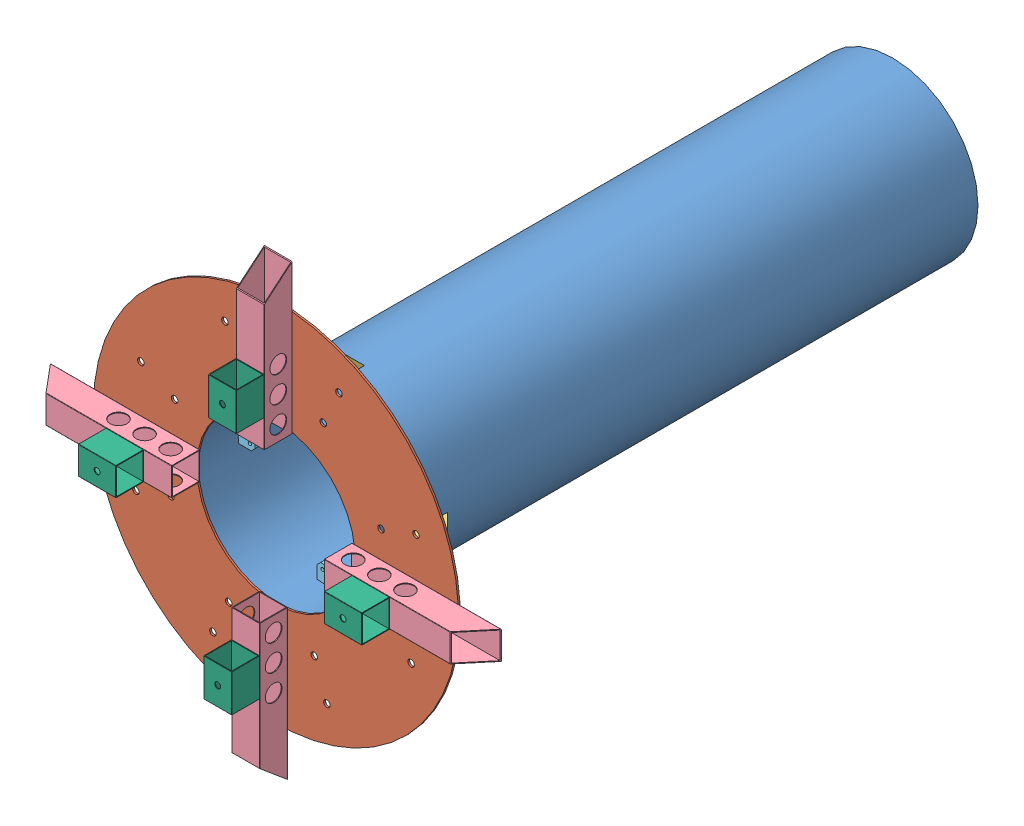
SolidWorks assembly STRUCTURE GARAGE.SLDASM, configuration Défaut (file format 8000). Lengths in mm.
Overall size (2419.76 2419.76 3610).
18 component instances, 6 part files, 14 mates.
Components (placement in the parent):
- Tube Central D915 ep 5 x 3300-1: Tube Central D915 ep 5 x 3300.SLDPRT [Défaut] at (-118.1447 12.3861 3300) size (915 915 3300)
- Anneau D1850 d950 ep 10-1: Anneau D1850 d950 ep 10.SLDPRT [Défaut] at (-118.1447 12.3861 6600) size (1960 1960 10)
- Equerre Renfort Anneaux Tube Central-1: Equerre Renfort Anneaux Tube Central.SLDPRT [Défaut] at (339.3553 0 6147.4517) x (0 0 1) z (0 1 0) size (452.55 452.55 10)
- Entretoise 150x150 ep4-1: Entretoise 150x150 ep4.SLDPRT [Défaut] at (291.737 -75 6610) x (0 1 0) z (1 0 0) size (150 150 800)
- Patte Fixation Garage Chlore-1: Patte Fixation Garage Chlore.SLDPRT [Défaut] at (244.3553 12.3861 6360) x (1 0 0) z (0 -1 0) size (90 50 60)
- Entretoise 150x150x200 ep4-1: Entretoise 150x150x200 ep4.SLDPRT [Défaut] at (641.737 75 6760) x (0 -1 0) z (-1 0 0) size (150 150 200)
- Equerre Renfort Anneaux Tube Central-2: Equerre Renfort Anneaux Tube Central.SLDPRT [Défaut] at (-130.5308 -445.1139 6147.4517) x (0 0 1) z (1 0 0) size (452.55 452.55 10)
- Equerre Renfort Anneaux Tube Central-3: Equerre Renfort Anneaux Tube Central.SLDPRT [Défaut] at (-575.6447 24.7723 6147.4517) x (0 0 1) z (0 -1 0) size (452.55 452.55 10)
- Equerre Renfort Anneaux Tube Central-4: Equerre Renfort Anneaux Tube Central.SLDPRT [Défaut] at (-105.7585 469.8861 6147.4517) x (0 0 1) z (-1 0 0) size (452.55 452.55 10)
- Patte Fixation Garage Chlore-2: Patte Fixation Garage Chlore.SLDPRT [Défaut] at (-118.1447 -350.1139 6360) x (0 -1 0) z (-1 0 0) size (90 50 60)
- Patte Fixation Garage Chlore-3: Patte Fixation Garage Chlore.SLDPRT [Défaut] at (-480.6447 12.3861 6360) x (-1 0 0) z (0 1 0) size (90 50 60)
- Patte Fixation Garage Chlore-4: Patte Fixation Garage Chlore.SLDPRT [Défaut] at (-118.1447 374.8861 6360) x (0 1 0) z (1 0 0) size (90 50 60)
- Entretoise 150x150 ep4-2: Entretoise 150x150 ep4.SLDPRT [Défaut] at (-205.5308 -397.4955 6610) x (1 0 0) z (0 -1 0) size (150 150 800)
- Entretoise 150x150 ep4-3: Entretoise 150x150 ep4.SLDPRT [Défaut] at (-528.0263 99.7723 6610) x (0 -1 0) z (-1 0 0) size (150 150 800)
- Entretoise 150x150 ep4-4: Entretoise 150x150 ep4.SLDPRT [Défaut] at (-30.7585 422.2678 6610) x (-1 0 0) z (0 1 0) size (150 150 800)
- Entretoise 150x150x200 ep4-2: Entretoise 150x150x200 ep4.SLDPRT [Défaut] at (-55.5308 -747.4955 6760) x (-1 0 0) z (0 1 0) size (150 150 200)
- Entretoise 150x150x200 ep4-3: Entretoise 150x150x200 ep4.SLDPRT [Défaut] at (-878.0263 -50.2277 6760) x (0 1 0) z (1 0 0) size (150 150 200)
- Entretoise 150x150x200 ep4-4: Entretoise 150x150x200 ep4.SLDPRT [Défaut] at (-180.7585 772.2678 6760) x (1 0 0) z (0 -1 0) size (150 150 200)
Mates (geometry in assembly coordinates):
- Coïncidente1: coincident anti-aligned: plane of Tube Central D915 ep 5 x 3300-1 through (-118.1447 12.3861 6600) normal (0 0 1); plane of Anneau D1850 d950 ep 10-1 through (-118.1447 12.3861 6600) normal (0 0 -1)
- Coaxiale1: concentric aligned: cylinder of Tube Central D915 ep 5 x 3300-1 through (-118.1447 12.3861 6600) axis (0 0 -1) radius 457.5; cylinder of Anneau D1850 d950 ep 10-1 through (-118.1447 12.3861 6610) axis (0 0 -1) radius 425
- Coïncidente2: coincident anti-aligned: plane of Equerre Renfort Anneaux Tube Central-1 through (339.3553 0 6147.4517) normal (0 -1 0); plane of assembly through (0 0 0) normal (0 1 0)
- Coïncidente3: coincident anti-aligned: plane of Anneau D1850 d950 ep 10-1 through (-118.1447 12.3861 6600) normal (0 0 -1); plane of Equerre Renfort Anneaux Tube Central-1 through (509.061 10 6600) normal (0 0 1)
- Tangent2: tangent anti-aligned: cylinder of Tube Central D915 ep 5 x 3300-1 through (-118.1447 12.3861 6600) axis (0 0 -1) radius 457.5; plane of Equerre Renfort Anneaux Tube Central-1 through (339.3553 10 6147.4517) normal (-1 0 0)
- Coaxiale2: concentric anti-aligned: cylinder of Tube Central D915 ep 5 x 3300-1 through (-118.1447 12.3861 6600) axis (0 0 -1) radius 452.5; cylinder of Patte Fixation Garage Chlore-1 through (-118.1447 12.3861 6310) axis (0 0 1) radius 452.5
- Distance1: distance = 250 mm aligned: plane of Patte Fixation Garage Chlore-1 through (244.3553 -17.6139 6360) normal (0 0 1); plane of Anneau D1850 d950 ep 10-1 through (-118.1447 12.3861 6610) normal (0 0 1)
- Parallèle1: parallel aligned: plane of Equerre Renfort Anneaux Tube Central-1 through (339.3553 0 6147.4517) normal (0 -1 0); plane of Patte Fixation Garage Chlore-1 through (244.3553 -17.6139 6360) normal (0 -1 0)
- Coïncidente6: coincident anti-aligned: plane of Anneau D1850 d950 ep 10-1 through (-118.1447 12.3861 6610) normal (0 0 1); plane of Entretoise 150x150 ep4-1 through (1091.737 73 6610) normal (0 0 -1)
- Distance2: distance = 75 mm aligned: plane of Equerre Renfort Anneaux Tube Central-1 through (339.3553 0 6147.4517) normal (0 -1 0); plane of Entretoise 150x150 ep4-1 through (1091.737 -75 6612) normal (0 -1 0)
- Distance4: distance = 300 mm: line of Entretoise 150x150 ep4-1 through (1091.737 -73 6610) axis (0 1 0); line of Equerre Renfort Anneaux Tube Central-1 through (791.9037 10 6600) axis (0 -1 0)
- Coïncidente11: coincident anti-aligned: plane of Entretoise 150x150 ep4-1 through (1091.737 -73 6760) normal (0 0 1); plane of Entretoise 150x150x200 ep4-1 through (441.737 73 6760) normal (0 0 -1)
- Coïncidente12: coincident aligned: plane of Entretoise 150x150 ep4-1 through (1091.737 -75 6612) normal (0 -1 0); plane of Entretoise 150x150x200 ep4-1 through (441.737 -75 6762) normal (0 -1 0)
- Distance5: distance = 150 mm aligned: plane of Entretoise 150x150 ep4-1 through (291.737 73 6612) normal (-1 0 0); plane of Entretoise 150x150x200 ep4-1 through (441.737 73 6762) normal (-1 0 0)
